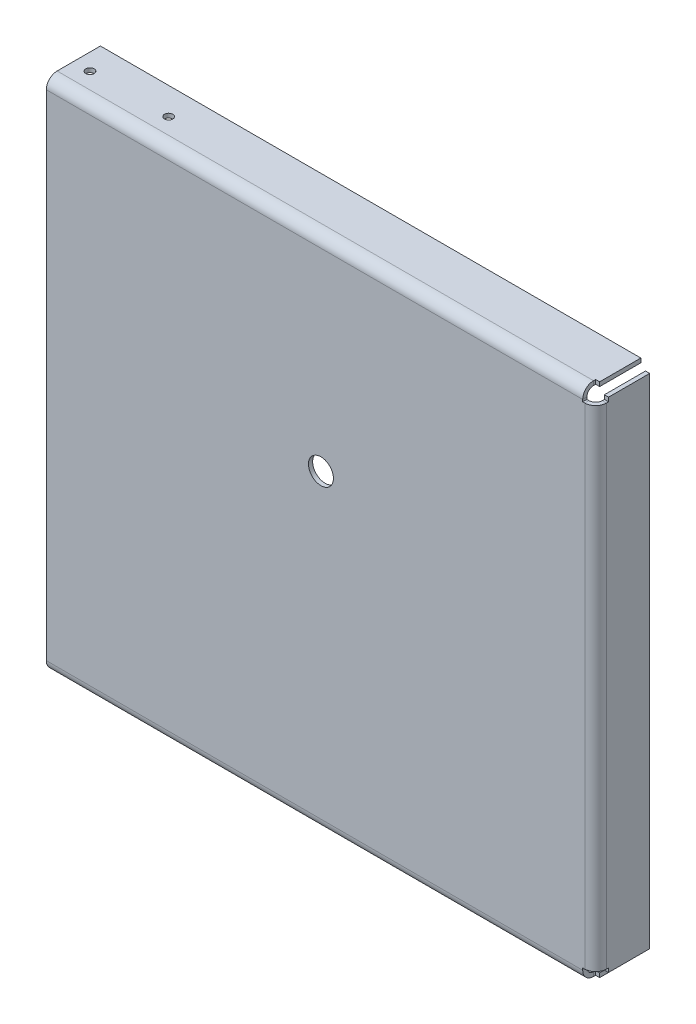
ISO-10303-21;
HEADER;
FILE_DESCRIPTION(('STEP AP214'),'2;1');
FILE_NAME('part.step','',(''),(''),'','','');
FILE_SCHEMA(('AUTOMOTIVE_DESIGN { 1 0 10303 214 1 1 1 1 }'));
ENDSEC;
DATA;
#1=APPLICATION_CONTEXT('core data for automotive mechanical design processes');
#2=APPLICATION_PROTOCOL_DEFINITION('international standard','automotive_design',2000,#1);
#3=PRODUCT_CONTEXT('',#1,'mechanical');
#4=PRODUCT('Part','Part','',(#3));
#5=PRODUCT_RELATED_PRODUCT_CATEGORY('part','',(#4));
#6=PRODUCT_DEFINITION_FORMATION('','',#4);
#7=PRODUCT_DEFINITION_CONTEXT('part definition',#1,'design');
#8=PRODUCT_DEFINITION('design','',#6,#7);
#9=PRODUCT_DEFINITION_SHAPE('','',#8);
#10=(LENGTH_UNIT() NAMED_UNIT(*) SI_UNIT(.MILLI.,.METRE.));
#11=(NAMED_UNIT(*) PLANE_ANGLE_UNIT() SI_UNIT($,.RADIAN.));
#12=(NAMED_UNIT(*) SI_UNIT($,.STERADIAN.) SOLID_ANGLE_UNIT());
#13=UNCERTAINTY_MEASURE_WITH_UNIT(LENGTH_MEASURE(1.E-05),#10,'distance_accuracy_value','');
#14=(GEOMETRIC_REPRESENTATION_CONTEXT(3) GLOBAL_UNCERTAINTY_ASSIGNED_CONTEXT((#13)) GLOBAL_UNIT_ASSIGNED_CONTEXT((#10,
#11,#12)) REPRESENTATION_CONTEXT('',''));
#15=CARTESIAN_POINT('',(0.,0.,0.));
#16=DIRECTION('',(0.,0.,1.));
#17=DIRECTION('',(1.,0.,0.));
#18=AXIS2_PLACEMENT_3D('',#15,#16,#17);
#19=CARTESIAN_POINT('',(517.316448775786,1666.19042069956,1.58749999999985));
#20=DIRECTION('',(-1.,0.,0.));
#21=DIRECTION('',(0.,-1.,0.));
#22=AXIS2_PLACEMENT_3D('',#19,#20,#21);
#23=PLANE('',#22);
#24=DIRECTION('',(0.,-1.,0.));
#25=VECTOR('',#24,1.);
#26=CARTESIAN_POINT('',(517.316448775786,1666.19042069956,-3.33375000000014));
#27=LINE('',#26,#25);
#28=CARTESIAN_POINT('',(517.316448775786,1252.5375,-3.33375000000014));
#29=VERTEX_POINT('',#28);
#30=CARTESIAN_POINT('',(517.316448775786,1250.95,-3.33375000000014));
#31=VERTEX_POINT('',#30);
#32=EDGE_CURVE('E463',#29,#31,#27,.T.);
#33=ORIENTED_EDGE('',*,*,#32,.T.);
#34=DIRECTION('',(0.,0.,1.));
#35=VECTOR('',#34,1.);
#36=CARTESIAN_POINT('',(517.316448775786,1250.95,-31.7500000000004));
#37=LINE('',#36,#35);
#38=CARTESIAN_POINT('',(517.316448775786,1250.95,-19.0500000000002));
#39=VERTEX_POINT('',#38);
#40=EDGE_CURVE('E86',#39,#31,#37,.T.);
#41=ORIENTED_EDGE('',*,*,#40,.F.);
#42=DIRECTION('',(0.,-1.,0.));
#43=VECTOR('',#42,1.);
#44=CARTESIAN_POINT('',(517.316448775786,1666.19042069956,-19.0500000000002));
#45=LINE('',#44,#43);
#46=CARTESIAN_POINT('',(517.316448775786,1252.5375,-19.0500000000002));
#47=VERTEX_POINT('',#46);
#48=EDGE_CURVE('E460',#47,#39,#45,.T.);
#49=ORIENTED_EDGE('',*,*,#48,.F.);
#50=DIRECTION('',(0.,0.,-1.));
#51=VECTOR('',#50,1.);
#52=CARTESIAN_POINT('',(517.316448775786,1252.5375,1.58749999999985));
#53=LINE('',#52,#51);
#54=EDGE_CURVE('E11',#29,#47,#53,.T.);
#55=ORIENTED_EDGE('',*,*,#54,.F.);
#56=EDGE_LOOP('',(#33,#41,#49,#55));
#57=FACE_BOUND('',#56,.T.);
#58=ADVANCED_FACE('F34',(#57),#23,.F.);
#59=CARTESIAN_POINT('',(311.15,1666.19042069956,-19.0500000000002));
#60=DIRECTION('',(0.,0.,-1.));
#61=DIRECTION('',(0.,1.,0.));
#62=AXIS2_PLACEMENT_3D('',#59,#60,#61);
#63=PLANE('',#62);
#64=DIRECTION('',(1.,0.,0.));
#65=VECTOR('',#64,1.);
#66=CARTESIAN_POINT('',(311.15,1250.95,-19.0500000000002));
#67=LINE('',#66,#65);
#68=CARTESIAN_POINT('',(311.15,1250.95,-19.0500000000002));
#69=VERTEX_POINT('',#68);
#70=EDGE_CURVE('E438',#69,#39,#67,.T.);
#71=ORIENTED_EDGE('',*,*,#70,.F.);
#72=DIRECTION('',(0.,-1.,0.));
#73=VECTOR('',#72,1.);
#74=CARTESIAN_POINT('',(311.15,1666.19042069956,-19.0500000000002));
#75=LINE('',#74,#73);
#76=CARTESIAN_POINT('',(311.15,1252.5375,-19.0500000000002));
#77=VERTEX_POINT('',#76);
#78=EDGE_CURVE('E432',#77,#69,#75,.T.);
#79=ORIENTED_EDGE('',*,*,#78,.F.);
#80=DIRECTION('',(1.,0.,0.));
#81=VECTOR('',#80,1.);
#82=CARTESIAN_POINT('',(311.15,1252.5375,-19.0500000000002));
#83=LINE('',#82,#81);
#84=EDGE_CURVE('E52',#77,#47,#83,.T.);
#85=ORIENTED_EDGE('',*,*,#84,.T.);
#86=ORIENTED_EDGE('',*,*,#48,.T.);
#87=EDGE_LOOP('',(#71,#79,#85,#86));
#88=FACE_BOUND('',#87,.T.);
#89=ADVANCED_FACE('F493',(#88),#63,.T.);
#90=CARTESIAN_POINT('',(317.5,1250.95,-8.73125000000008));
#91=DIRECTION('',(0.,1.,0.));
#92=DIRECTION('',(0.,0.,1.));
#93=AXIS2_PLACEMENT_3D('',#90,#91,#92);
#94=CYLINDRICAL_SURFACE('',#93,1.58750000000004);
#95=CARTESIAN_POINT('',(317.5,1252.5375,-8.73125000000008));
#96=DIRECTION('',(0.,1.,0.));
#97=DIRECTION('',(0.,0.,1.));
#98=AXIS2_PLACEMENT_3D('',#95,#96,#97);
#99=CIRCLE('',#98,1.58750000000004);
#100=CARTESIAN_POINT('',(317.5,1252.5375,-7.14375000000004));
#101=VERTEX_POINT('',#100);
#102=EDGE_CURVE('E457',#101,#101,#99,.T.);
#103=ORIENTED_EDGE('',*,*,#102,.T.);
#104=EDGE_LOOP('',(#103));
#105=FACE_BOUND('',#104,.T.);
#106=CARTESIAN_POINT('',(317.5,1250.95,-8.73125000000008));
#107=DIRECTION('',(0.,1.,0.));
#108=DIRECTION('',(0.,0.,1.));
#109=AXIS2_PLACEMENT_3D('',#106,#107,#108);
#110=CIRCLE('',#109,1.58750000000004);
#111=CARTESIAN_POINT('',(317.5,1250.95,-7.14375000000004));
#112=VERTEX_POINT('',#111);
#113=EDGE_CURVE('E445',#112,#112,#110,.T.);
#114=ORIENTED_EDGE('',*,*,#113,.F.);
#115=EDGE_LOOP('',(#114));
#116=FACE_BOUND('',#115,.T.);
#117=ADVANCED_FACE('F495',(#105,#116),#94,.F.);
#118=CARTESIAN_POINT('',(311.15,1666.19042069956,-3.33375000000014));
#119=DIRECTION('',(0.,0.,1.));
#120=DIRECTION('',(0.,-1.,0.));
#121=AXIS2_PLACEMENT_3D('',#118,#119,#120);
#122=PLANE('',#121);
#123=DIRECTION('',(-1.,0.,0.));
#124=VECTOR('',#123,1.);
#125=CARTESIAN_POINT('',(311.15,1250.95,-3.33375000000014));
#126=LINE('',#125,#124);
#127=CARTESIAN_POINT('',(515.77875,1250.95,-3.33375000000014));
#128=VERTEX_POINT('',#127);
#129=EDGE_CURVE('E79',#31,#128,#126,.T.);
#130=ORIENTED_EDGE('',*,*,#129,.F.);
#131=ORIENTED_EDGE('',*,*,#32,.F.);
#132=DIRECTION('',(-1.,0.,0.));
#133=VECTOR('',#132,1.);
#134=CARTESIAN_POINT('',(311.15,1252.5375,-3.33375000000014));
#135=LINE('',#134,#133);
#136=CARTESIAN_POINT('',(515.77875,1252.5375,-3.33375000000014));
#137=VERTEX_POINT('',#136);
#138=EDGE_CURVE('E454',#29,#137,#135,.T.);
#139=ORIENTED_EDGE('',*,*,#138,.T.);
#140=DIRECTION('',(0.,-1.,0.));
#141=VECTOR('',#140,1.);
#142=CARTESIAN_POINT('',(515.77875,1666.19042069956,-3.33375000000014));
#143=LINE('',#142,#141);
#144=EDGE_CURVE('E452',#137,#128,#143,.T.);
#145=ORIENTED_EDGE('',*,*,#144,.T.);
#146=EDGE_LOOP('',(#130,#131,#139,#145));
#147=FACE_BOUND('',#146,.T.);
#148=ADVANCED_FACE('F490',(#147),#122,.T.);
#149=CARTESIAN_POINT('',(515.77875,1666.19042069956,1.58749999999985));
#150=DIRECTION('',(-1.,0.,0.));
#151=DIRECTION('',(0.,-1.,0.));
#152=AXIS2_PLACEMENT_3D('',#149,#150,#151);
#153=PLANE('',#152);
#154=DIRECTION('',(0.,-1.,0.));
#155=VECTOR('',#154,1.);
#156=CARTESIAN_POINT('',(515.77875,1666.19042069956,-2.53999999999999));
#157=LINE('',#156,#155);
#158=CARTESIAN_POINT('',(515.77875,1252.5375,-2.54000000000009));
#159=VERTEX_POINT('',#158);
#160=CARTESIAN_POINT('',(515.77875,1250.95,-2.54000000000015));
#161=VERTEX_POINT('',#160);
#162=EDGE_CURVE('E450',#159,#161,#157,.T.);
#163=ORIENTED_EDGE('',*,*,#162,.T.);
#164=DIRECTION('',(0.,0.,-1.));
#165=VECTOR('',#164,1.);
#166=CARTESIAN_POINT('',(515.77875,1250.95,1.58749999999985));
#167=LINE('',#166,#165);
#168=EDGE_CURVE('E448',#161,#128,#167,.T.);
#169=ORIENTED_EDGE('',*,*,#168,.T.);
#170=ORIENTED_EDGE('',*,*,#144,.F.);
#171=DIRECTION('',(0.,0.,-1.));
#172=VECTOR('',#171,1.);
#173=CARTESIAN_POINT('',(515.77875,1252.5375,1.58749999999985));
#174=LINE('',#173,#172);
#175=EDGE_CURVE('E44',#159,#137,#174,.T.);
#176=ORIENTED_EDGE('',*,*,#175,.F.);
#177=EDGE_LOOP('',(#163,#169,#170,#176));
#178=FACE_BOUND('',#177,.T.);
#179=ADVANCED_FACE('F489',(#178),#153,.F.);
#180=CARTESIAN_POINT('',(311.15,1250.95,1.58749999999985));
#181=DIRECTION('',(0.,1.,0.));
#182=DIRECTION('',(0.,0.,1.));
#183=AXIS2_PLACEMENT_3D('',#180,#181,#182);
#184=PLANE('',#183);
#185=CARTESIAN_POINT('',(347.5,1250.95,-8.73125));
#186=DIRECTION('',(0.,1.,0.));
#187=DIRECTION('',(0.,0.,1.));
#188=AXIS2_PLACEMENT_3D('',#185,#186,#187);
#189=CIRCLE('',#188,1.58750000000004);
#190=CARTESIAN_POINT('',(347.5,1250.95,-7.14374999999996));
#191=VERTEX_POINT('',#190);
#192=EDGE_CURVE('E530',#191,#191,#189,.T.);
#193=ORIENTED_EDGE('',*,*,#192,.T.);
#194=EDGE_LOOP('',(#193));
#195=FACE_BOUND('',#194,.T.);
#196=ORIENTED_EDGE('',*,*,#113,.T.);
#197=EDGE_LOOP('',(#196));
#198=FACE_BOUND('',#197,.T.);
#199=ORIENTED_EDGE('',*,*,#168,.F.);
#200=DIRECTION('',(-1.,0.,0.));
#201=VECTOR('',#200,1.);
#202=CARTESIAN_POINT('',(515.77875,1250.95,-2.53999999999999));
#203=LINE('',#202,#201);
#204=CARTESIAN_POINT('',(311.15,1250.95,-2.53999999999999));
#205=VERTEX_POINT('',#204);
#206=EDGE_CURVE('E292',#161,#205,#203,.T.);
#207=ORIENTED_EDGE('',*,*,#206,.T.);
#208=DIRECTION('',(0.,0.,-1.));
#209=VECTOR('',#208,1.);
#210=CARTESIAN_POINT('',(311.15,1250.95,1.58749999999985));
#211=LINE('',#210,#209);
#212=EDGE_CURVE('E441',#205,#69,#211,.T.);
#213=ORIENTED_EDGE('',*,*,#212,.T.);
#214=ORIENTED_EDGE('',*,*,#70,.T.);
#215=ORIENTED_EDGE('',*,*,#40,.T.);
#216=ORIENTED_EDGE('',*,*,#129,.T.);
#217=EDGE_LOOP('',(#199,#207,#213,#214,#215,#216));
#218=FACE_BOUND('',#217,.T.);
#219=ADVANCED_FACE('F486',(#195,#198,#218),#184,.F.);
#220=CARTESIAN_POINT('',(311.15,1666.19042069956,1.58749999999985));
#221=DIRECTION('',(-1.,0.,0.));
#222=DIRECTION('',(0.,-1.,0.));
#223=AXIS2_PLACEMENT_3D('',#220,#221,#222);
#224=PLANE('',#223);
#225=ORIENTED_EDGE('',*,*,#212,.F.);
#226=DIRECTION('',(0.,-1.,0.));
#227=VECTOR('',#226,1.);
#228=CARTESIAN_POINT('',(311.15,1666.19042069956,-2.53999999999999));
#229=LINE('',#228,#227);
#230=CARTESIAN_POINT('',(311.15,1252.5375,-2.54000000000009));
#231=VERTEX_POINT('',#230);
#232=EDGE_CURVE('E465',#231,#205,#229,.T.);
#233=ORIENTED_EDGE('',*,*,#232,.F.);
#234=DIRECTION('',(0.,0.,-1.));
#235=VECTOR('',#234,1.);
#236=CARTESIAN_POINT('',(311.15,1252.5375,1.58749999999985));
#237=LINE('',#236,#235);
#238=EDGE_CURVE('E434',#231,#77,#237,.T.);
#239=ORIENTED_EDGE('',*,*,#238,.T.);
#240=ORIENTED_EDGE('',*,*,#78,.T.);
#241=EDGE_LOOP('',(#225,#233,#239,#240));
#242=FACE_BOUND('',#241,.T.);
#243=ADVANCED_FACE('F482',(#242),#224,.T.);
#244=CARTESIAN_POINT('',(311.15,1252.5375,1.58749999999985));
#245=DIRECTION('',(0.,1.,0.));
#246=DIRECTION('',(0.,0.,1.));
#247=AXIS2_PLACEMENT_3D('',#244,#245,#246);
#248=PLANE('',#247);
#249=CARTESIAN_POINT('',(347.5,1252.5375,-8.73125));
#250=DIRECTION('',(0.,1.,0.));
#251=DIRECTION('',(0.,0.,1.));
#252=AXIS2_PLACEMENT_3D('',#249,#250,#251);
#253=CIRCLE('',#252,1.58750000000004);
#254=CARTESIAN_POINT('',(347.5,1252.5375,-7.14374999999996));
#255=VERTEX_POINT('',#254);
#256=EDGE_CURVE('E525',#255,#255,#253,.T.);
#257=ORIENTED_EDGE('',*,*,#256,.F.);
#258=EDGE_LOOP('',(#257));
#259=FACE_BOUND('',#258,.T.);
#260=DIRECTION('',(-1.,0.,0.));
#261=VECTOR('',#260,1.);
#262=CARTESIAN_POINT('',(515.77875,1252.5375,-2.53999999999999));
#263=LINE('',#262,#261);
#264=EDGE_CURVE('E376',#159,#231,#263,.T.);
#265=ORIENTED_EDGE('',*,*,#264,.F.);
#266=ORIENTED_EDGE('',*,*,#175,.T.);
#267=ORIENTED_EDGE('',*,*,#138,.F.);
#268=ORIENTED_EDGE('',*,*,#54,.T.);
#269=ORIENTED_EDGE('',*,*,#84,.F.);
#270=ORIENTED_EDGE('',*,*,#238,.F.);
#271=EDGE_LOOP('',(#265,#266,#267,#268,#269,#270));
#272=FACE_BOUND('',#271,.T.);
#273=ORIENTED_EDGE('',*,*,#102,.F.);
#274=EDGE_LOOP('',(#273));
#275=FACE_BOUND('',#274,.T.);
#276=ADVANCED_FACE('F36',(#259,#272,#275),#248,.T.);
#277=CARTESIAN_POINT('',(137.515392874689,1444.41644877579,1.58749999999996));
#278=DIRECTION('',(0.,-1.,0.));
#279=DIRECTION('',(-1.,0.,0.));
#280=AXIS2_PLACEMENT_3D('',#277,#278,#279);
#281=PLANE('',#280);
#282=DIRECTION('',(1.,0.,0.));
#283=VECTOR('',#282,1.);
#284=CARTESIAN_POINT('',(137.515392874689,1444.41644877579,-3.33375000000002));
#285=LINE('',#284,#283);
#286=CARTESIAN_POINT('',(519.1125,1444.41644877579,-3.33375000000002));
#287=VERTEX_POINT('',#286);
#288=CARTESIAN_POINT('',(520.7,1444.41644877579,-3.33375000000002));
#289=VERTEX_POINT('',#288);
#290=EDGE_CURVE('E425',#287,#289,#285,.T.);
#291=ORIENTED_EDGE('',*,*,#290,.T.);
#292=DIRECTION('',(0.,0.,1.));
#293=VECTOR('',#292,1.);
#294=CARTESIAN_POINT('',(520.7,1444.41644877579,-31.7499999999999));
#295=LINE('',#294,#293);
#296=CARTESIAN_POINT('',(520.7,1444.41644877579,-19.05));
#297=VERTEX_POINT('',#296);
#298=EDGE_CURVE('E391',#297,#289,#295,.T.);
#299=ORIENTED_EDGE('',*,*,#298,.F.);
#300=DIRECTION('',(1.,0.,0.));
#301=VECTOR('',#300,1.);
#302=CARTESIAN_POINT('',(137.515392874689,1444.41644877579,-19.05));
#303=LINE('',#302,#301);
#304=CARTESIAN_POINT('',(519.1125,1444.41644877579,-19.05));
#305=VERTEX_POINT('',#304);
#306=EDGE_CURVE('E422',#305,#297,#303,.T.);
#307=ORIENTED_EDGE('',*,*,#306,.F.);
#308=DIRECTION('',(0.,0.,-1.));
#309=VECTOR('',#308,1.);
#310=CARTESIAN_POINT('',(519.1125,1444.41644877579,1.58749999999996));
#311=LINE('',#310,#309);
#312=EDGE_CURVE('E142',#287,#305,#311,.T.);
#313=ORIENTED_EDGE('',*,*,#312,.F.);
#314=EDGE_LOOP('',(#291,#299,#307,#313));
#315=FACE_BOUND('',#314,.T.);
#316=ADVANCED_FACE('F516',(#315),#281,.F.);
#317=CARTESIAN_POINT('',(137.515392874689,1250.95,-19.05));
#318=DIRECTION('',(0.,0.,-1.));
#319=DIRECTION('',(-1.,0.,0.));
#320=AXIS2_PLACEMENT_3D('',#317,#318,#319);
#321=PLANE('',#320);
#322=DIRECTION('',(0.,1.,0.));
#323=VECTOR('',#322,1.);
#324=CARTESIAN_POINT('',(520.7,1250.95,-19.05));
#325=LINE('',#324,#323);
#326=CARTESIAN_POINT('',(520.7,1254.33355122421,-19.05));
#327=VERTEX_POINT('',#326);
#328=EDGE_CURVE('E393',#327,#297,#325,.T.);
#329=ORIENTED_EDGE('',*,*,#328,.F.);
#330=DIRECTION('',(1.,0.,0.));
#331=VECTOR('',#330,1.);
#332=CARTESIAN_POINT('',(137.515392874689,1254.33355122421,-19.05));
#333=LINE('',#332,#331);
#334=CARTESIAN_POINT('',(519.1125,1254.33355122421,-19.05));
#335=VERTEX_POINT('',#334);
#336=EDGE_CURVE('E419',#335,#327,#333,.T.);
#337=ORIENTED_EDGE('',*,*,#336,.F.);
#338=DIRECTION('',(0.,1.,0.));
#339=VECTOR('',#338,1.);
#340=CARTESIAN_POINT('',(519.1125,1250.95,-19.05));
#341=LINE('',#340,#339);
#342=EDGE_CURVE('E135',#335,#305,#341,.T.);
#343=ORIENTED_EDGE('',*,*,#342,.T.);
#344=ORIENTED_EDGE('',*,*,#306,.T.);
#345=EDGE_LOOP('',(#329,#337,#343,#344));
#346=FACE_BOUND('',#345,.T.);
#347=ADVANCED_FACE('F521',(#346),#321,.T.);
#348=CARTESIAN_POINT('',(137.515392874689,1254.33355122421,1.58749999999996));
#349=DIRECTION('',(0.,1.,0.));
#350=DIRECTION('',(1.,0.,0.));
#351=AXIS2_PLACEMENT_3D('',#348,#349,#350);
#352=PLANE('',#351);
#353=ORIENTED_EDGE('',*,*,#336,.T.);
#354=DIRECTION('',(0.,0.,1.));
#355=VECTOR('',#354,1.);
#356=CARTESIAN_POINT('',(520.7,1254.33355122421,-31.7500000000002));
#357=LINE('',#356,#355);
#358=CARTESIAN_POINT('',(520.7,1254.33355122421,-3.33375000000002));
#359=VERTEX_POINT('',#358);
#360=EDGE_CURVE('E416',#327,#359,#357,.T.);
#361=ORIENTED_EDGE('',*,*,#360,.T.);
#362=DIRECTION('',(1.,0.,0.));
#363=VECTOR('',#362,1.);
#364=CARTESIAN_POINT('',(137.515392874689,1254.33355122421,-3.33375000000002));
#365=LINE('',#364,#363);
#366=CARTESIAN_POINT('',(519.1125,1254.33355122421,-3.33375000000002));
#367=VERTEX_POINT('',#366);
#368=EDGE_CURVE('E411',#367,#359,#365,.T.);
#369=ORIENTED_EDGE('',*,*,#368,.F.);
#370=DIRECTION('',(0.,0.,1.));
#371=VECTOR('',#370,1.);
#372=CARTESIAN_POINT('',(519.1125,1254.33355122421,1.58749999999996));
#373=LINE('',#372,#371);
#374=EDGE_CURVE('E377',#335,#367,#373,.T.);
#375=ORIENTED_EDGE('',*,*,#374,.F.);
#376=EDGE_LOOP('',(#353,#361,#369,#375));
#377=FACE_BOUND('',#376,.T.);
#378=ADVANCED_FACE('F683',(#377),#352,.F.);
#379=CARTESIAN_POINT('',(137.515392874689,1250.95,-3.33375000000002));
#380=DIRECTION('',(0.,0.,1.));
#381=DIRECTION('',(1.,0.,0.));
#382=AXIS2_PLACEMENT_3D('',#379,#380,#381);
#383=PLANE('',#382);
#384=DIRECTION('',(0.,-1.,0.));
#385=VECTOR('',#384,1.);
#386=CARTESIAN_POINT('',(520.7,1250.95,-3.33375000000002));
#387=LINE('',#386,#385);
#388=CARTESIAN_POINT('',(520.7,1255.87125,-3.33375000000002));
#389=VERTEX_POINT('',#388);
#390=EDGE_CURVE('E395',#389,#359,#387,.T.);
#391=ORIENTED_EDGE('',*,*,#390,.F.);
#392=DIRECTION('',(1.,0.,0.));
#393=VECTOR('',#392,1.);
#394=CARTESIAN_POINT('',(137.515392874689,1255.87125,-3.33375000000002));
#395=LINE('',#394,#393);
#396=CARTESIAN_POINT('',(519.1125,1255.87125,-3.33375000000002));
#397=VERTEX_POINT('',#396);
#398=EDGE_CURVE('E387',#397,#389,#395,.T.);
#399=ORIENTED_EDGE('',*,*,#398,.F.);
#400=DIRECTION('',(0.,-1.,0.));
#401=VECTOR('',#400,1.);
#402=CARTESIAN_POINT('',(519.1125,1250.95,-3.33375000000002));
#403=LINE('',#402,#401);
#404=EDGE_CURVE('E414',#397,#367,#403,.T.);
#405=ORIENTED_EDGE('',*,*,#404,.T.);
#406=ORIENTED_EDGE('',*,*,#368,.T.);
#407=EDGE_LOOP('',(#391,#399,#405,#406));
#408=FACE_BOUND('',#407,.T.);
#409=ADVANCED_FACE('F686',(#408),#383,.T.);
#410=CARTESIAN_POINT('',(137.515392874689,1250.95,-3.33375000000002));
#411=DIRECTION('',(0.,0.,1.));
#412=DIRECTION('',(1.,0.,0.));
#413=AXIS2_PLACEMENT_3D('',#410,#411,#412);
#414=PLANE('',#413);
#415=DIRECTION('',(0.,-1.,0.));
#416=VECTOR('',#415,1.);
#417=CARTESIAN_POINT('',(520.7,1250.95,-3.33375000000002));
#418=LINE('',#417,#416);
#419=CARTESIAN_POINT('',(520.7,1442.87875,-3.33375000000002));
#420=VERTEX_POINT('',#419);
#421=EDGE_CURVE('E389',#289,#420,#418,.T.);
#422=ORIENTED_EDGE('',*,*,#421,.F.);
#423=ORIENTED_EDGE('',*,*,#290,.F.);
#424=DIRECTION('',(0.,-1.,0.));
#425=VECTOR('',#424,1.);
#426=CARTESIAN_POINT('',(519.1125,1250.95,-3.33375000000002));
#427=LINE('',#426,#425);
#428=CARTESIAN_POINT('',(519.1125,1442.87875,-3.33375000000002));
#429=VERTEX_POINT('',#428);
#430=EDGE_CURVE('E409',#287,#429,#427,.T.);
#431=ORIENTED_EDGE('',*,*,#430,.T.);
#432=DIRECTION('',(1.,0.,0.));
#433=VECTOR('',#432,1.);
#434=CARTESIAN_POINT('',(137.515392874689,1442.87875,-3.33375000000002));
#435=LINE('',#434,#433);
#436=EDGE_CURVE('E406',#429,#420,#435,.T.);
#437=ORIENTED_EDGE('',*,*,#436,.T.);
#438=EDGE_LOOP('',(#422,#423,#431,#437));
#439=FACE_BOUND('',#438,.T.);
#440=ADVANCED_FACE('F690',(#439),#414,.T.);
#441=CARTESIAN_POINT('',(137.515392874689,1442.87875,1.58749999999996));
#442=DIRECTION('',(0.,-1.,0.));
#443=DIRECTION('',(-1.,0.,0.));
#444=AXIS2_PLACEMENT_3D('',#441,#442,#443);
#445=PLANE('',#444);
#446=DIRECTION('',(1.,0.,0.));
#447=VECTOR('',#446,1.);
#448=CARTESIAN_POINT('',(137.515392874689,1442.87875,-2.53999999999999));
#449=LINE('',#448,#447);
#450=CARTESIAN_POINT('',(519.1125,1442.87875,-2.53999999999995));
#451=VERTEX_POINT('',#450);
#452=CARTESIAN_POINT('',(520.7,1442.87875,-2.53999999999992));
#453=VERTEX_POINT('',#452);
#454=EDGE_CURVE('E403',#451,#453,#449,.T.);
#455=ORIENTED_EDGE('',*,*,#454,.T.);
#456=DIRECTION('',(0.,0.,-1.));
#457=VECTOR('',#456,1.);
#458=CARTESIAN_POINT('',(520.7,1442.87875,1.58749999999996));
#459=LINE('',#458,#457);
#460=EDGE_CURVE('E400',#453,#420,#459,.T.);
#461=ORIENTED_EDGE('',*,*,#460,.T.);
#462=ORIENTED_EDGE('',*,*,#436,.F.);
#463=DIRECTION('',(0.,0.,-1.));
#464=VECTOR('',#463,1.);
#465=CARTESIAN_POINT('',(519.1125,1442.87875,1.58749999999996));
#466=LINE('',#465,#464);
#467=EDGE_CURVE('E381',#451,#429,#466,.T.);
#468=ORIENTED_EDGE('',*,*,#467,.F.);
#469=EDGE_LOOP('',(#455,#461,#462,#468));
#470=FACE_BOUND('',#469,.T.);
#471=ADVANCED_FACE('F694',(#470),#445,.F.);
#472=CARTESIAN_POINT('',(520.7,1250.95,1.58749999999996));
#473=DIRECTION('',(-1.,0.,0.));
#474=DIRECTION('',(0.,0.,1.));
#475=AXIS2_PLACEMENT_3D('',#472,#473,#474);
#476=PLANE('',#475);
#477=ORIENTED_EDGE('',*,*,#460,.F.);
#478=DIRECTION('',(0.,-1.,0.));
#479=VECTOR('',#478,1.);
#480=CARTESIAN_POINT('',(520.7,1442.87875,-2.53999999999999));
#481=LINE('',#480,#479);
#482=CARTESIAN_POINT('',(520.7,1255.87125,-2.53999999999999));
#483=VERTEX_POINT('',#482);
#484=EDGE_CURVE('E397',#453,#483,#481,.T.);
#485=ORIENTED_EDGE('',*,*,#484,.T.);
#486=DIRECTION('',(0.,0.,1.));
#487=VECTOR('',#486,1.);
#488=CARTESIAN_POINT('',(520.7,1255.87125,1.58749999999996));
#489=LINE('',#488,#487);
#490=EDGE_CURVE('E384',#389,#483,#489,.T.);
#491=ORIENTED_EDGE('',*,*,#490,.F.);
#492=ORIENTED_EDGE('',*,*,#390,.T.);
#493=ORIENTED_EDGE('',*,*,#360,.F.);
#494=ORIENTED_EDGE('',*,*,#328,.T.);
#495=ORIENTED_EDGE('',*,*,#298,.T.);
#496=ORIENTED_EDGE('',*,*,#421,.T.);
#497=EDGE_LOOP('',(#477,#485,#491,#492,#493,#494,#495,#496));
#498=FACE_BOUND('',#497,.T.);
#499=ADVANCED_FACE('F600',(#498),#476,.F.);
#500=CARTESIAN_POINT('',(137.515392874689,1255.87125,1.58749999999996));
#501=DIRECTION('',(0.,1.,0.));
#502=DIRECTION('',(1.,0.,0.));
#503=AXIS2_PLACEMENT_3D('',#500,#501,#502);
#504=PLANE('',#503);
#505=ORIENTED_EDGE('',*,*,#398,.T.);
#506=ORIENTED_EDGE('',*,*,#490,.T.);
#507=DIRECTION('',(1.,0.,0.));
#508=VECTOR('',#507,1.);
#509=CARTESIAN_POINT('',(137.515392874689,1255.87125,-2.53999999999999));
#510=LINE('',#509,#508);
#511=CARTESIAN_POINT('',(519.1125,1255.87125,-2.53999999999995));
#512=VERTEX_POINT('',#511);
#513=EDGE_CURVE('E427',#512,#483,#510,.T.);
#514=ORIENTED_EDGE('',*,*,#513,.F.);
#515=DIRECTION('',(0.,0.,1.));
#516=VECTOR('',#515,1.);
#517=CARTESIAN_POINT('',(519.1125,1255.87125,1.58749999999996));
#518=LINE('',#517,#516);
#519=EDGE_CURVE('E95',#397,#512,#518,.T.);
#520=ORIENTED_EDGE('',*,*,#519,.F.);
#521=EDGE_LOOP('',(#505,#506,#514,#520));
#522=FACE_BOUND('',#521,.T.);
#523=ADVANCED_FACE('F596',(#522),#504,.F.);
#524=CARTESIAN_POINT('',(519.1125,1250.95,1.58749999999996));
#525=DIRECTION('',(-1.,0.,0.));
#526=DIRECTION('',(0.,0.,1.));
#527=AXIS2_PLACEMENT_3D('',#524,#525,#526);
#528=PLANE('',#527);
#529=DIRECTION('',(0.,-1.,0.));
#530=VECTOR('',#529,1.);
#531=CARTESIAN_POINT('',(519.1125,1442.87875,-2.53999999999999));
#532=LINE('',#531,#530);
#533=EDGE_CURVE('E329',#451,#512,#532,.T.);
#534=ORIENTED_EDGE('',*,*,#533,.F.);
#535=ORIENTED_EDGE('',*,*,#467,.T.);
#536=ORIENTED_EDGE('',*,*,#430,.F.);
#537=ORIENTED_EDGE('',*,*,#312,.T.);
#538=ORIENTED_EDGE('',*,*,#342,.F.);
#539=ORIENTED_EDGE('',*,*,#374,.T.);
#540=ORIENTED_EDGE('',*,*,#404,.F.);
#541=ORIENTED_EDGE('',*,*,#519,.T.);
#542=EDGE_LOOP('',(#534,#535,#536,#537,#538,#539,#540,#541));
#543=FACE_BOUND('',#542,.T.);
#544=ADVANCED_FACE('F657',(#543),#528,.T.);
#545=CARTESIAN_POINT('',(517.316448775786,1032.55957930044,1.58749999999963));
#546=DIRECTION('',(-1.,0.,0.));
#547=DIRECTION('',(0.,1.,0.));
#548=AXIS2_PLACEMENT_3D('',#545,#546,#547);
#549=PLANE('',#548);
#550=DIRECTION('',(0.,1.,0.));
#551=VECTOR('',#550,1.);
#552=CARTESIAN_POINT('',(517.316448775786,1032.55957930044,-19.0500000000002));
#553=LINE('',#552,#551);
#554=CARTESIAN_POINT('',(517.316448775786,1446.2125,-19.0500000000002));
#555=VERTEX_POINT('',#554);
#556=CARTESIAN_POINT('',(517.316448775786,1447.8,-19.0500000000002));
#557=VERTEX_POINT('',#556);
#558=EDGE_CURVE('E369',#555,#557,#553,.T.);
#559=ORIENTED_EDGE('',*,*,#558,.T.);
#560=DIRECTION('',(0.,0.,1.));
#561=VECTOR('',#560,1.);
#562=CARTESIAN_POINT('',(517.316448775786,1447.8,-31.7500000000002));
#563=LINE('',#562,#561);
#564=CARTESIAN_POINT('',(517.316448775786,1447.8,-3.33375000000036));
#565=VERTEX_POINT('',#564);
#566=EDGE_CURVE('E366',#557,#565,#563,.T.);
#567=ORIENTED_EDGE('',*,*,#566,.T.);
#568=DIRECTION('',(0.,1.,0.));
#569=VECTOR('',#568,1.);
#570=CARTESIAN_POINT('',(517.316448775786,1032.55957930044,-3.33375000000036));
#571=LINE('',#570,#569);
#572=CARTESIAN_POINT('',(517.316448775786,1446.2125,-3.33375000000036));
#573=VERTEX_POINT('',#572);
#574=EDGE_CURVE('E363',#573,#565,#571,.T.);
#575=ORIENTED_EDGE('',*,*,#574,.F.);
#576=DIRECTION('',(0.,0.,1.));
#577=VECTOR('',#576,1.);
#578=CARTESIAN_POINT('',(517.316448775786,1446.2125,1.58749999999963));
#579=LINE('',#578,#577);
#580=EDGE_CURVE('E184',#555,#573,#579,.T.);
#581=ORIENTED_EDGE('',*,*,#580,.F.);
#582=EDGE_LOOP('',(#559,#567,#575,#581));
#583=FACE_BOUND('',#582,.T.);
#584=ADVANCED_FACE('F653',(#583),#549,.F.);
#585=CARTESIAN_POINT('',(520.7,1032.55957930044,-3.33375000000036));
#586=DIRECTION('',(0.,0.,1.));
#587=DIRECTION('',(0.,-1.,0.));
#588=AXIS2_PLACEMENT_3D('',#585,#586,#587);
#589=PLANE('',#588);
#590=DIRECTION('',(1.,0.,0.));
#591=VECTOR('',#590,1.);
#592=CARTESIAN_POINT('',(520.7,1447.8,-3.33375000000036));
#593=LINE('',#592,#591);
#594=CARTESIAN_POINT('',(515.77875,1447.8,-3.33375000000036));
#595=VERTEX_POINT('',#594);
#596=EDGE_CURVE('E341',#595,#565,#593,.T.);
#597=ORIENTED_EDGE('',*,*,#596,.F.);
#598=DIRECTION('',(0.,1.,0.));
#599=VECTOR('',#598,1.);
#600=CARTESIAN_POINT('',(515.77875,1032.55957930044,-3.33375000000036));
#601=LINE('',#600,#599);
#602=CARTESIAN_POINT('',(515.77875,1446.2125,-3.33375000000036));
#603=VERTEX_POINT('',#602);
#604=EDGE_CURVE('E337',#603,#595,#601,.T.);
#605=ORIENTED_EDGE('',*,*,#604,.F.);
#606=DIRECTION('',(1.,0.,0.));
#607=VECTOR('',#606,1.);
#608=CARTESIAN_POINT('',(520.7,1446.2125,-3.33375000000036));
#609=LINE('',#608,#607);
#610=EDGE_CURVE('E178',#603,#573,#609,.T.);
#611=ORIENTED_EDGE('',*,*,#610,.T.);
#612=ORIENTED_EDGE('',*,*,#574,.T.);
#613=EDGE_LOOP('',(#597,#605,#611,#612));
#614=FACE_BOUND('',#613,.T.);
#615=ADVANCED_FACE('F656',(#614),#589,.T.);
#616=CARTESIAN_POINT('',(317.5,1250.95,-8.7312500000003));
#617=DIRECTION('',(0.,1.,0.));
#618=DIRECTION('',(0.,0.,1.));
#619=AXIS2_PLACEMENT_3D('',#616,#617,#618);
#620=CYLINDRICAL_SURFACE('',#619,1.58750000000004);
#621=CARTESIAN_POINT('',(317.5,1446.2125,-8.7312500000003));
#622=DIRECTION('',(0.,-1.,0.));
#623=DIRECTION('',(0.,0.,-1.));
#624=AXIS2_PLACEMENT_3D('',#621,#622,#623);
#625=CIRCLE('',#624,1.58750000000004);
#626=CARTESIAN_POINT('',(317.5,1446.2125,-10.3187500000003));
#627=VERTEX_POINT('',#626);
#628=EDGE_CURVE('E360',#627,#627,#625,.T.);
#629=ORIENTED_EDGE('',*,*,#628,.T.);
#630=EDGE_LOOP('',(#629));
#631=FACE_BOUND('',#630,.T.);
#632=CARTESIAN_POINT('',(317.5,1447.8,-8.7312500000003));
#633=DIRECTION('',(0.,1.,0.));
#634=DIRECTION('',(0.,0.,1.));
#635=AXIS2_PLACEMENT_3D('',#632,#633,#634);
#636=CIRCLE('',#635,1.58750000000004);
#637=CARTESIAN_POINT('',(317.5,1447.8,-7.14375000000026));
#638=VERTEX_POINT('',#637);
#639=EDGE_CURVE('E357',#638,#638,#636,.T.);
#640=ORIENTED_EDGE('',*,*,#639,.T.);
#641=EDGE_LOOP('',(#640));
#642=FACE_BOUND('',#641,.T.);
#643=ADVANCED_FACE('F660',(#631,#642),#620,.F.);
#644=CARTESIAN_POINT('',(520.7,1032.55957930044,-19.0500000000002));
#645=DIRECTION('',(0.,0.,-1.));
#646=DIRECTION('',(0.,1.,0.));
#647=AXIS2_PLACEMENT_3D('',#644,#645,#646);
#648=PLANE('',#647);
#649=DIRECTION('',(-1.,0.,0.));
#650=VECTOR('',#649,1.);
#651=CARTESIAN_POINT('',(520.7,1447.8,-19.0500000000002));
#652=LINE('',#651,#650);
#653=CARTESIAN_POINT('',(311.15,1447.8,-19.0500000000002));
#654=VERTEX_POINT('',#653);
#655=EDGE_CURVE('E339',#557,#654,#652,.T.);
#656=ORIENTED_EDGE('',*,*,#655,.F.);
#657=ORIENTED_EDGE('',*,*,#558,.F.);
#658=DIRECTION('',(-1.,0.,0.));
#659=VECTOR('',#658,1.);
#660=CARTESIAN_POINT('',(520.7,1446.2125,-19.0500000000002));
#661=LINE('',#660,#659);
#662=CARTESIAN_POINT('',(311.15,1446.2125,-19.0500000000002));
#663=VERTEX_POINT('',#662);
#664=EDGE_CURVE('E355',#555,#663,#661,.T.);
#665=ORIENTED_EDGE('',*,*,#664,.T.);
#666=DIRECTION('',(0.,1.,0.));
#667=VECTOR('',#666,1.);
#668=CARTESIAN_POINT('',(311.15,1032.55957930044,-19.0500000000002));
#669=LINE('',#668,#667);
#670=EDGE_CURVE('E352',#663,#654,#669,.T.);
#671=ORIENTED_EDGE('',*,*,#670,.T.);
#672=EDGE_LOOP('',(#656,#657,#665,#671));
#673=FACE_BOUND('',#672,.T.);
#674=ADVANCED_FACE('F663',(#673),#648,.T.);
#675=CARTESIAN_POINT('',(311.15,1032.55957930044,1.58749999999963));
#676=DIRECTION('',(1.,0.,0.));
#677=DIRECTION('',(0.,-1.,0.));
#678=AXIS2_PLACEMENT_3D('',#675,#676,#677);
#679=PLANE('',#678);
#680=DIRECTION('',(0.,1.,0.));
#681=VECTOR('',#680,1.);
#682=CARTESIAN_POINT('',(311.15,1032.55957930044,-2.53999999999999));
#683=LINE('',#682,#681);
#684=CARTESIAN_POINT('',(311.15,1446.2125,-2.54000000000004));
#685=VERTEX_POINT('',#684);
#686=CARTESIAN_POINT('',(311.15,1447.8,-2.54000000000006));
#687=VERTEX_POINT('',#686);
#688=EDGE_CURVE('E349',#685,#687,#683,.T.);
#689=ORIENTED_EDGE('',*,*,#688,.T.);
#690=DIRECTION('',(0.,0.,-1.));
#691=VECTOR('',#690,1.);
#692=CARTESIAN_POINT('',(311.15,1447.8,1.58749999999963));
#693=LINE('',#692,#691);
#694=EDGE_CURVE('E346',#687,#654,#693,.T.);
#695=ORIENTED_EDGE('',*,*,#694,.T.);
#696=ORIENTED_EDGE('',*,*,#670,.F.);
#697=DIRECTION('',(0.,0.,-1.));
#698=VECTOR('',#697,1.);
#699=CARTESIAN_POINT('',(311.15,1446.2125,1.58749999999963));
#700=LINE('',#699,#698);
#701=EDGE_CURVE('E331',#685,#663,#700,.T.);
#702=ORIENTED_EDGE('',*,*,#701,.F.);
#703=EDGE_LOOP('',(#689,#695,#696,#702));
#704=FACE_BOUND('',#703,.T.);
#705=ADVANCED_FACE('F667',(#704),#679,.F.);
#706=CARTESIAN_POINT('',(520.7,1447.8,1.58749999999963));
#707=DIRECTION('',(0.,-1.,0.));
#708=DIRECTION('',(0.,0.,-1.));
#709=AXIS2_PLACEMENT_3D('',#706,#707,#708);
#710=PLANE('',#709);
#711=CARTESIAN_POINT('',(347.5,1447.8,-8.73125));
#712=DIRECTION('',(0.,1.,0.));
#713=DIRECTION('',(0.,0.,1.));
#714=AXIS2_PLACEMENT_3D('',#711,#712,#713);
#715=CIRCLE('',#714,1.58750000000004);
#716=CARTESIAN_POINT('',(347.5,1447.8,-7.14374999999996));
#717=VERTEX_POINT('',#716);
#718=EDGE_CURVE('E532',#717,#717,#715,.T.);
#719=ORIENTED_EDGE('',*,*,#718,.F.);
#720=EDGE_LOOP('',(#719));
#721=FACE_BOUND('',#720,.T.);
#722=ORIENTED_EDGE('',*,*,#639,.F.);
#723=EDGE_LOOP('',(#722));
#724=FACE_BOUND('',#723,.T.);
#725=ORIENTED_EDGE('',*,*,#694,.F.);
#726=DIRECTION('',(1.,0.,0.));
#727=VECTOR('',#726,1.);
#728=CARTESIAN_POINT('',(311.15,1447.8,-2.53999999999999));
#729=LINE('',#728,#727);
#730=CARTESIAN_POINT('',(515.77875,1447.8,-2.53999999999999));
#731=VERTEX_POINT('',#730);
#732=EDGE_CURVE('E343',#687,#731,#729,.T.);
#733=ORIENTED_EDGE('',*,*,#732,.T.);
#734=DIRECTION('',(0.,0.,1.));
#735=VECTOR('',#734,1.);
#736=CARTESIAN_POINT('',(515.77875,1447.8,1.58749999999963));
#737=LINE('',#736,#735);
#738=EDGE_CURVE('E334',#595,#731,#737,.T.);
#739=ORIENTED_EDGE('',*,*,#738,.F.);
#740=ORIENTED_EDGE('',*,*,#596,.T.);
#741=ORIENTED_EDGE('',*,*,#566,.F.);
#742=ORIENTED_EDGE('',*,*,#655,.T.);
#743=EDGE_LOOP('',(#725,#733,#739,#740,#741,#742));
#744=FACE_BOUND('',#743,.T.);
#745=ADVANCED_FACE('F626',(#721,#724,#744),#710,.F.);
#746=CARTESIAN_POINT('',(515.77875,1032.55957930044,1.58749999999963));
#747=DIRECTION('',(-1.,0.,0.));
#748=DIRECTION('',(0.,1.,0.));
#749=AXIS2_PLACEMENT_3D('',#746,#747,#748);
#750=PLANE('',#749);
#751=ORIENTED_EDGE('',*,*,#604,.T.);
#752=ORIENTED_EDGE('',*,*,#738,.T.);
#753=DIRECTION('',(0.,1.,0.));
#754=VECTOR('',#753,1.);
#755=CARTESIAN_POINT('',(515.77875,1032.55957930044,-2.53999999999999));
#756=LINE('',#755,#754);
#757=CARTESIAN_POINT('',(515.778749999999,1446.2125,-2.54000000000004));
#758=VERTEX_POINT('',#757);
#759=EDGE_CURVE('E371',#758,#731,#756,.T.);
#760=ORIENTED_EDGE('',*,*,#759,.F.);
#761=DIRECTION('',(0.,0.,1.));
#762=VECTOR('',#761,1.);
#763=CARTESIAN_POINT('',(515.77875,1446.2125,1.58749999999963));
#764=LINE('',#763,#762);
#765=EDGE_CURVE('E151',#603,#758,#764,.T.);
#766=ORIENTED_EDGE('',*,*,#765,.F.);
#767=EDGE_LOOP('',(#751,#752,#760,#766));
#768=FACE_BOUND('',#767,.T.);
#769=ADVANCED_FACE('F622',(#768),#750,.F.);
#770=CARTESIAN_POINT('',(520.7,1446.2125,1.58749999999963));
#771=DIRECTION('',(0.,-1.,0.));
#772=DIRECTION('',(0.,0.,-1.));
#773=AXIS2_PLACEMENT_3D('',#770,#771,#772);
#774=PLANE('',#773);
#775=CARTESIAN_POINT('',(347.5,1446.2125,-8.73125));
#776=DIRECTION('',(0.,-1.,0.));
#777=DIRECTION('',(0.,0.,-1.));
#778=AXIS2_PLACEMENT_3D('',#775,#776,#777);
#779=CIRCLE('',#778,1.58750000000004);
#780=CARTESIAN_POINT('',(347.5,1446.2125,-10.31875));
#781=VERTEX_POINT('',#780);
#782=EDGE_CURVE('E38',#781,#781,#779,.T.);
#783=ORIENTED_EDGE('',*,*,#782,.F.);
#784=EDGE_LOOP('',(#783));
#785=FACE_BOUND('',#784,.T.);
#786=DIRECTION('',(1.,0.,0.));
#787=VECTOR('',#786,1.);
#788=CARTESIAN_POINT('',(311.15,1446.2125,-2.53999999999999));
#789=LINE('',#788,#787);
#790=EDGE_CURVE('E284',#685,#758,#789,.T.);
#791=ORIENTED_EDGE('',*,*,#790,.F.);
#792=ORIENTED_EDGE('',*,*,#701,.T.);
#793=ORIENTED_EDGE('',*,*,#664,.F.);
#794=ORIENTED_EDGE('',*,*,#580,.T.);
#795=ORIENTED_EDGE('',*,*,#610,.F.);
#796=ORIENTED_EDGE('',*,*,#765,.T.);
#797=EDGE_LOOP('',(#791,#792,#793,#794,#795,#796));
#798=FACE_BOUND('',#797,.T.);
#799=ORIENTED_EDGE('',*,*,#628,.F.);
#800=EDGE_LOOP('',(#799));
#801=FACE_BOUND('',#800,.T.);
#802=ADVANCED_FACE('F677',(#785,#798,#801),#774,.T.);
#803=CARTESIAN_POINT('',(311.15,1250.95,1.5875));
#804=DIRECTION('',(0.,0.,1.));
#805=DIRECTION('',(1.,0.,0.));
#806=AXIS2_PLACEMENT_3D('',#803,#804,#805);
#807=PLANE('',#806);
#808=CARTESIAN_POINT('',(415.925,1370.0125,1.5875));
#809=DIRECTION('',(0.,0.,1.));
#810=DIRECTION('',(1.,0.,0.));
#811=AXIS2_PLACEMENT_3D('',#808,#809,#810);
#812=CIRCLE('',#811,4.7625);
#813=CARTESIAN_POINT('',(420.6875,1370.0125,1.5875));
#814=VERTEX_POINT('',#813);
#815=EDGE_CURVE('E300',#814,#814,#812,.T.);
#816=ORIENTED_EDGE('',*,*,#815,.F.);
#817=EDGE_LOOP('',(#816));
#818=FACE_BOUND('',#817,.T.);
#819=DIRECTION('',(0.,-1.,0.));
#820=VECTOR('',#819,1.);
#821=CARTESIAN_POINT('',(311.15,1447.8,1.5875));
#822=LINE('',#821,#820);
#823=CARTESIAN_POINT('',(311.15,1443.6725,1.5875));
#824=VERTEX_POINT('',#823);
#825=CARTESIAN_POINT('',(311.15,1255.0775,1.5875));
#826=VERTEX_POINT('',#825);
#827=EDGE_CURVE('E306',#824,#826,#822,.T.);
#828=ORIENTED_EDGE('',*,*,#827,.T.);
#829=DIRECTION('',(1.,0.,0.));
#830=VECTOR('',#829,1.);
#831=CARTESIAN_POINT('',(515.77875,1255.0775,1.58749999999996));
#832=LINE('',#831,#830);
#833=CARTESIAN_POINT('',(515.77875,1255.0775,1.58749999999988));
#834=VERTEX_POINT('',#833);
#835=EDGE_CURVE('E289',#826,#834,#832,.T.);
#836=ORIENTED_EDGE('',*,*,#835,.T.);
#837=DIRECTION('',(0.,1.,0.));
#838=VECTOR('',#837,1.);
#839=CARTESIAN_POINT('',(515.77875,1250.95,1.5875));
#840=LINE('',#839,#838);
#841=CARTESIAN_POINT('',(515.77875,1255.87125,1.58749999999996));
#842=VERTEX_POINT('',#841);
#843=EDGE_CURVE('E200',#834,#842,#840,.T.);
#844=ORIENTED_EDGE('',*,*,#843,.T.);
#845=DIRECTION('',(1.,0.,0.));
#846=VECTOR('',#845,1.);
#847=CARTESIAN_POINT('',(311.15,1255.87125,1.5875));
#848=LINE('',#847,#846);
#849=CARTESIAN_POINT('',(516.5725,1255.87125,1.5875));
#850=VERTEX_POINT('',#849);
#851=EDGE_CURVE('E299',#842,#850,#848,.T.);
#852=ORIENTED_EDGE('',*,*,#851,.T.);
#853=DIRECTION('',(0.,1.,0.));
#854=VECTOR('',#853,1.);
#855=CARTESIAN_POINT('',(516.5725,1442.87875,1.58749999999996));
#856=LINE('',#855,#854);
#857=CARTESIAN_POINT('',(516.5725,1442.87875,1.5875));
#858=VERTEX_POINT('',#857);
#859=EDGE_CURVE('E312',#850,#858,#856,.T.);
#860=ORIENTED_EDGE('',*,*,#859,.T.);
#861=DIRECTION('',(-1.,0.,0.));
#862=VECTOR('',#861,1.);
#863=CARTESIAN_POINT('',(311.15,1442.87875,1.5875));
#864=LINE('',#863,#862);
#865=CARTESIAN_POINT('',(515.77875,1442.87875,1.5875));
#866=VERTEX_POINT('',#865);
#867=EDGE_CURVE('E573',#858,#866,#864,.T.);
#868=ORIENTED_EDGE('',*,*,#867,.T.);
#869=DIRECTION('',(0.,1.,0.));
#870=VECTOR('',#869,1.);
#871=CARTESIAN_POINT('',(515.77875,1250.95,1.5875));
#872=LINE('',#871,#870);
#873=CARTESIAN_POINT('',(515.77875,1443.6725,1.5875));
#874=VERTEX_POINT('',#873);
#875=EDGE_CURVE('E575',#866,#874,#872,.T.);
#876=ORIENTED_EDGE('',*,*,#875,.T.);
#877=DIRECTION('',(-1.,0.,0.));
#878=VECTOR('',#877,1.);
#879=CARTESIAN_POINT('',(311.15,1443.6725,1.58749999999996));
#880=LINE('',#879,#878);
#881=EDGE_CURVE('E308',#874,#824,#880,.T.);
#882=ORIENTED_EDGE('',*,*,#881,.T.);
#883=EDGE_LOOP('',(#828,#836,#844,#852,#860,#868,#876,#882));
#884=FACE_BOUND('',#883,.T.);
#885=ADVANCED_FACE('F303',(#818,#884),#807,.T.);
#886=CARTESIAN_POINT('',(311.15,1250.95,0.));
#887=DIRECTION('',(0.,0.,1.));
#888=DIRECTION('',(1.,0.,0.));
#889=AXIS2_PLACEMENT_3D('',#886,#887,#888);
#890=PLANE('',#889);
#891=CARTESIAN_POINT('',(415.925,1370.0125,0.));
#892=DIRECTION('',(0.,0.,1.));
#893=DIRECTION('',(1.,0.,0.));
#894=AXIS2_PLACEMENT_3D('',#891,#892,#893);
#895=CIRCLE('',#894,4.7625);
#896=CARTESIAN_POINT('',(420.6875,1370.0125,0.));
#897=VERTEX_POINT('',#896);
#898=EDGE_CURVE('E553',#897,#897,#895,.T.);
#899=ORIENTED_EDGE('',*,*,#898,.T.);
#900=EDGE_LOOP('',(#899));
#901=FACE_BOUND('',#900,.T.);
#902=DIRECTION('',(1.,0.,0.));
#903=VECTOR('',#902,1.);
#904=CARTESIAN_POINT('',(515.77875,1255.0775,0.));
#905=LINE('',#904,#903);
#906=CARTESIAN_POINT('',(311.15,1255.0775,0.));
#907=VERTEX_POINT('',#906);
#908=CARTESIAN_POINT('',(515.77875,1255.0775,0.));
#909=VERTEX_POINT('',#908);
#910=EDGE_CURVE('E585',#907,#909,#905,.T.);
#911=ORIENTED_EDGE('',*,*,#910,.F.);
#912=DIRECTION('',(0.,-1.,0.));
#913=VECTOR('',#912,1.);
#914=CARTESIAN_POINT('',(311.15,1447.8,0.));
#915=LINE('',#914,#913);
#916=CARTESIAN_POINT('',(311.15,1443.6725,0.));
#917=VERTEX_POINT('',#916);
#918=EDGE_CURVE('E564',#917,#907,#915,.T.);
#919=ORIENTED_EDGE('',*,*,#918,.F.);
#920=DIRECTION('',(-1.,0.,0.));
#921=VECTOR('',#920,1.);
#922=CARTESIAN_POINT('',(311.15,1443.6725,0.));
#923=LINE('',#922,#921);
#924=CARTESIAN_POINT('',(515.778749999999,1443.6725,0.));
#925=VERTEX_POINT('',#924);
#926=EDGE_CURVE('E582',#925,#917,#923,.T.);
#927=ORIENTED_EDGE('',*,*,#926,.F.);
#928=DIRECTION('',(0.,1.,0.));
#929=VECTOR('',#928,1.);
#930=CARTESIAN_POINT('',(515.77875,1250.95,0.));
#931=LINE('',#930,#929);
#932=CARTESIAN_POINT('',(515.77875,1442.87875,0.));
#933=VERTEX_POINT('',#932);
#934=EDGE_CURVE('E566',#933,#925,#931,.T.);
#935=ORIENTED_EDGE('',*,*,#934,.F.);
#936=DIRECTION('',(-1.,0.,0.));
#937=VECTOR('',#936,1.);
#938=CARTESIAN_POINT('',(311.15,1442.87875,0.));
#939=LINE('',#938,#937);
#940=CARTESIAN_POINT('',(516.5725,1442.87875,0.));
#941=VERTEX_POINT('',#940);
#942=EDGE_CURVE('E192',#941,#933,#939,.T.);
#943=ORIENTED_EDGE('',*,*,#942,.F.);
#944=DIRECTION('',(0.,1.,0.));
#945=VECTOR('',#944,1.);
#946=CARTESIAN_POINT('',(516.5725,1442.87875,0.));
#947=LINE('',#946,#945);
#948=CARTESIAN_POINT('',(516.5725,1255.87125,0.));
#949=VERTEX_POINT('',#948);
#950=EDGE_CURVE('E579',#949,#941,#947,.T.);
#951=ORIENTED_EDGE('',*,*,#950,.F.);
#952=DIRECTION('',(1.,0.,0.));
#953=VECTOR('',#952,1.);
#954=CARTESIAN_POINT('',(311.15,1255.87125,0.));
#955=LINE('',#954,#953);
#956=CARTESIAN_POINT('',(515.77875,1255.87125,0.));
#957=VERTEX_POINT('',#956);
#958=EDGE_CURVE('E559',#957,#949,#955,.T.);
#959=ORIENTED_EDGE('',*,*,#958,.F.);
#960=DIRECTION('',(0.,1.,0.));
#961=VECTOR('',#960,1.);
#962=CARTESIAN_POINT('',(515.77875,1250.95,0.));
#963=LINE('',#962,#961);
#964=EDGE_CURVE('E562',#909,#957,#963,.T.);
#965=ORIENTED_EDGE('',*,*,#964,.F.);
#966=EDGE_LOOP('',(#911,#919,#927,#935,#943,#951,#959,#965));
#967=FACE_BOUND('',#966,.T.);
#968=ADVANCED_FACE('F609',(#901,#967),#890,.F.);
#969=CARTESIAN_POINT('',(415.925,1370.0125,1.5875));
#970=DIRECTION('',(0.,0.,1.));
#971=DIRECTION('',(1.,0.,0.));
#972=AXIS2_PLACEMENT_3D('',#969,#970,#971);
#973=CYLINDRICAL_SURFACE('',#972,4.7625);
#974=ORIENTED_EDGE('',*,*,#815,.T.);
#975=EDGE_LOOP('',(#974));
#976=FACE_BOUND('',#975,.T.);
#977=ORIENTED_EDGE('',*,*,#898,.F.);
#978=EDGE_LOOP('',(#977));
#979=FACE_BOUND('',#978,.T.);
#980=ADVANCED_FACE('F652',(#976,#979),#973,.F.);
#981=CARTESIAN_POINT('',(515.77875,1250.95,-557.732830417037));
#982=DIRECTION('',(1.,0.,0.));
#983=DIRECTION('',(0.,0.,-1.));
#984=AXIS2_PLACEMENT_3D('',#981,#982,#983);
#985=PLANE('',#984);
#986=DIRECTION('',(0.,0.,1.));
#987=VECTOR('',#986,1.);
#988=CARTESIAN_POINT('',(515.77875,1255.87125,-557.732830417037));
#989=LINE('',#988,#987);
#990=EDGE_CURVE('E298',#957,#842,#989,.T.);
#991=ORIENTED_EDGE('',*,*,#990,.T.);
#992=ORIENTED_EDGE('',*,*,#843,.F.);
#993=DIRECTION('',(0.,0.,1.));
#994=VECTOR('',#993,1.);
#995=CARTESIAN_POINT('',(515.77875,1255.0775,-557.732830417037));
#996=LINE('',#995,#994);
#997=EDGE_CURVE('E273',#909,#834,#996,.T.);
#998=ORIENTED_EDGE('',*,*,#997,.F.);
#999=ORIENTED_EDGE('',*,*,#964,.T.);
#1000=EDGE_LOOP('',(#991,#992,#998,#999));
#1001=FACE_BOUND('',#1000,.T.);
#1002=ADVANCED_FACE('F297',(#1001),#985,.T.);
#1003=CARTESIAN_POINT('',(311.15,1447.8,-557.732830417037));
#1004=DIRECTION('',(-1.,0.,0.));
#1005=DIRECTION('',(0.,-1.,0.));
#1006=AXIS2_PLACEMENT_3D('',#1003,#1004,#1005);
#1007=PLANE('',#1006);
#1008=DIRECTION('',(0.,0.,1.));
#1009=VECTOR('',#1008,1.);
#1010=CARTESIAN_POINT('',(311.15,1255.0775,-557.732830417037));
#1011=LINE('',#1010,#1009);
#1012=EDGE_CURVE('E285',#907,#826,#1011,.T.);
#1013=ORIENTED_EDGE('',*,*,#1012,.T.);
#1014=ORIENTED_EDGE('',*,*,#827,.F.);
#1015=DIRECTION('',(0.,0.,1.));
#1016=VECTOR('',#1015,1.);
#1017=CARTESIAN_POINT('',(311.15,1443.6725,-557.732830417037));
#1018=LINE('',#1017,#1016);
#1019=EDGE_CURVE('E325',#917,#824,#1018,.T.);
#1020=ORIENTED_EDGE('',*,*,#1019,.F.);
#1021=ORIENTED_EDGE('',*,*,#918,.T.);
#1022=EDGE_LOOP('',(#1013,#1014,#1020,#1021));
#1023=FACE_BOUND('',#1022,.T.);
#1024=ADVANCED_FACE('F632',(#1023),#1007,.T.);
#1025=CARTESIAN_POINT('',(515.77875,1250.95,-557.732830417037));
#1026=DIRECTION('',(1.,0.,0.));
#1027=DIRECTION('',(0.,0.,-1.));
#1028=AXIS2_PLACEMENT_3D('',#1025,#1026,#1027);
#1029=PLANE('',#1028);
#1030=DIRECTION('',(0.,0.,1.));
#1031=VECTOR('',#1030,1.);
#1032=CARTESIAN_POINT('',(515.77875,1443.6725,-557.732830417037));
#1033=LINE('',#1032,#1031);
#1034=EDGE_CURVE('E322',#925,#874,#1033,.T.);
#1035=ORIENTED_EDGE('',*,*,#1034,.T.);
#1036=ORIENTED_EDGE('',*,*,#875,.F.);
#1037=DIRECTION('',(0.,0.,1.));
#1038=VECTOR('',#1037,1.);
#1039=CARTESIAN_POINT('',(515.77875,1442.87875,-557.732830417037));
#1040=LINE('',#1039,#1038);
#1041=EDGE_CURVE('E320',#933,#866,#1040,.T.);
#1042=ORIENTED_EDGE('',*,*,#1041,.F.);
#1043=ORIENTED_EDGE('',*,*,#934,.T.);
#1044=EDGE_LOOP('',(#1035,#1036,#1042,#1043));
#1045=FACE_BOUND('',#1044,.T.);
#1046=ADVANCED_FACE('F614',(#1045),#1029,.T.);
#1047=CARTESIAN_POINT('',(311.15,1442.87875,-557.732830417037));
#1048=DIRECTION('',(0.,1.,0.));
#1049=DIRECTION('',(0.,0.,1.));
#1050=AXIS2_PLACEMENT_3D('',#1047,#1048,#1049);
#1051=PLANE('',#1050);
#1052=ORIENTED_EDGE('',*,*,#1041,.T.);
#1053=ORIENTED_EDGE('',*,*,#867,.F.);
#1054=DIRECTION('',(0.,0.,1.));
#1055=VECTOR('',#1054,1.);
#1056=CARTESIAN_POINT('',(516.5725,1442.87875,-557.732830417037));
#1057=LINE('',#1056,#1055);
#1058=EDGE_CURVE('E318',#941,#858,#1057,.T.);
#1059=ORIENTED_EDGE('',*,*,#1058,.F.);
#1060=ORIENTED_EDGE('',*,*,#942,.T.);
#1061=EDGE_LOOP('',(#1052,#1053,#1059,#1060));
#1062=FACE_BOUND('',#1061,.T.);
#1063=ADVANCED_FACE('F604',(#1062),#1051,.T.);
#1064=CARTESIAN_POINT('',(311.15,1255.87125,-557.732830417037));
#1065=DIRECTION('',(0.,-1.,0.));
#1066=DIRECTION('',(0.,0.,-1.));
#1067=AXIS2_PLACEMENT_3D('',#1064,#1065,#1066);
#1068=PLANE('',#1067);
#1069=DIRECTION('',(0.,0.,1.));
#1070=VECTOR('',#1069,1.);
#1071=CARTESIAN_POINT('',(516.5725,1255.87125,-557.732830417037));
#1072=LINE('',#1071,#1070);
#1073=EDGE_CURVE('E310',#949,#850,#1072,.T.);
#1074=ORIENTED_EDGE('',*,*,#1073,.T.);
#1075=ORIENTED_EDGE('',*,*,#851,.F.);
#1076=ORIENTED_EDGE('',*,*,#990,.F.);
#1077=ORIENTED_EDGE('',*,*,#958,.T.);
#1078=EDGE_LOOP('',(#1074,#1075,#1076,#1077));
#1079=FACE_BOUND('',#1078,.T.);
#1080=ADVANCED_FACE('F634',(#1079),#1068,.T.);
#1081=CARTESIAN_POINT('',(311.15,1443.6725,-2.54));
#1082=DIRECTION('',(-1.,0.,0.));
#1083=DIRECTION('',(0.,0.,1.));
#1084=AXIS2_PLACEMENT_3D('',#1081,#1082,#1083);
#1085=PLANE('',#1084);
#1086=ORIENTED_EDGE('',*,*,#688,.F.);
#1087=CARTESIAN_POINT('',(311.15,1443.6725,-2.54));
#1088=DIRECTION('',(1.,0.,0.));
#1089=DIRECTION('',(0.,0.,-1.));
#1090=AXIS2_PLACEMENT_3D('',#1087,#1088,#1089);
#1091=CIRCLE('',#1090,2.54000000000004);
#1092=EDGE_CURVE('E543',#685,#917,#1091,.T.);
#1093=ORIENTED_EDGE('',*,*,#1092,.T.);
#1094=ORIENTED_EDGE('',*,*,#1019,.T.);
#1095=CARTESIAN_POINT('',(311.15,1443.6725,-2.54));
#1096=DIRECTION('',(1.,0.,0.));
#1097=DIRECTION('',(0.,0.,-1.));
#1098=AXIS2_PLACEMENT_3D('',#1095,#1096,#1097);
#1099=CIRCLE('',#1098,4.1275);
#1100=EDGE_CURVE('E547',#687,#824,#1099,.T.);
#1101=ORIENTED_EDGE('',*,*,#1100,.F.);
#1102=EDGE_LOOP('',(#1086,#1093,#1094,#1101));
#1103=FACE_BOUND('',#1102,.T.);
#1104=ADVANCED_FACE('F628',(#1103),#1085,.T.);
#1105=CARTESIAN_POINT('',(515.778749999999,1443.6725,-2.54));
#1106=DIRECTION('',(1.,0.,0.));
#1107=DIRECTION('',(0.,0.,-1.));
#1108=AXIS2_PLACEMENT_3D('',#1105,#1106,#1107);
#1109=PLANE('',#1108);
#1110=CARTESIAN_POINT('',(515.778749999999,1443.6725,-2.54));
#1111=DIRECTION('',(1.,0.,0.));
#1112=DIRECTION('',(0.,0.,-1.));
#1113=AXIS2_PLACEMENT_3D('',#1110,#1111,#1112);
#1114=CIRCLE('',#1113,2.54000000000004);
#1115=EDGE_CURVE('E551',#925,#758,#1114,.F.);
#1116=ORIENTED_EDGE('',*,*,#1115,.T.);
#1117=ORIENTED_EDGE('',*,*,#759,.T.);
#1118=CARTESIAN_POINT('',(515.778749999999,1443.6725,-2.54));
#1119=DIRECTION('',(1.,0.,0.));
#1120=DIRECTION('',(0.,0.,-1.));
#1121=AXIS2_PLACEMENT_3D('',#1118,#1119,#1120);
#1122=CIRCLE('',#1121,4.1275);
#1123=EDGE_CURVE('E550',#874,#731,#1122,.F.);
#1124=ORIENTED_EDGE('',*,*,#1123,.F.);
#1125=ORIENTED_EDGE('',*,*,#1034,.F.);
#1126=EDGE_LOOP('',(#1116,#1117,#1124,#1125));
#1127=FACE_BOUND('',#1126,.T.);
#1128=ADVANCED_FACE('F620',(#1127),#1109,.T.);
#1129=CARTESIAN_POINT('',(-13.616548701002,1443.6725,-2.54));
#1130=DIRECTION('',(1.,0.,0.));
#1131=DIRECTION('',(0.,0.,-1.));
#1132=AXIS2_PLACEMENT_3D('',#1129,#1130,#1131);
#1133=CYLINDRICAL_SURFACE('',#1132,4.1275);
#1134=ORIENTED_EDGE('',*,*,#881,.F.);
#1135=ORIENTED_EDGE('',*,*,#1123,.T.);
#1136=ORIENTED_EDGE('',*,*,#732,.F.);
#1137=ORIENTED_EDGE('',*,*,#1100,.T.);
#1138=EDGE_LOOP('',(#1134,#1135,#1136,#1137));
#1139=FACE_BOUND('',#1138,.T.);
#1140=ADVANCED_FACE('F617',(#1139),#1133,.T.);
#1141=CARTESIAN_POINT('',(-13.616548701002,1443.6725,-2.54));
#1142=DIRECTION('',(1.,0.,0.));
#1143=DIRECTION('',(0.,0.,-1.));
#1144=AXIS2_PLACEMENT_3D('',#1141,#1142,#1143);
#1145=CYLINDRICAL_SURFACE('',#1144,2.54000000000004);
#1146=ORIENTED_EDGE('',*,*,#926,.T.);
#1147=ORIENTED_EDGE('',*,*,#1092,.F.);
#1148=ORIENTED_EDGE('',*,*,#790,.T.);
#1149=ORIENTED_EDGE('',*,*,#1115,.F.);
#1150=EDGE_LOOP('',(#1146,#1147,#1148,#1149));
#1151=FACE_BOUND('',#1150,.T.);
#1152=ADVANCED_FACE('F729',(#1151),#1145,.F.);
#1153=CARTESIAN_POINT('',(516.5725,1442.87875,-2.54));
#1154=DIRECTION('',(0.,1.,0.));
#1155=DIRECTION('',(0.,0.,1.));
#1156=AXIS2_PLACEMENT_3D('',#1153,#1154,#1155);
#1157=PLANE('',#1156);
#1158=ORIENTED_EDGE('',*,*,#454,.F.);
#1159=CARTESIAN_POINT('',(516.5725,1442.87875,-2.54));
#1160=DIRECTION('',(0.,-1.,0.));
#1161=DIRECTION('',(0.,0.,-1.));
#1162=AXIS2_PLACEMENT_3D('',#1159,#1160,#1161);
#1163=CIRCLE('',#1162,2.54000000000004);
#1164=EDGE_CURVE('E535',#451,#941,#1163,.T.);
#1165=ORIENTED_EDGE('',*,*,#1164,.T.);
#1166=ORIENTED_EDGE('',*,*,#1058,.T.);
#1167=CARTESIAN_POINT('',(516.5725,1442.87875,-2.54));
#1168=DIRECTION('',(0.,-1.,0.));
#1169=DIRECTION('',(0.,0.,-1.));
#1170=AXIS2_PLACEMENT_3D('',#1167,#1168,#1169);
#1171=CIRCLE('',#1170,4.1275);
#1172=EDGE_CURVE('E537',#453,#858,#1171,.T.);
#1173=ORIENTED_EDGE('',*,*,#1172,.F.);
#1174=EDGE_LOOP('',(#1158,#1165,#1166,#1173));
#1175=FACE_BOUND('',#1174,.T.);
#1176=ADVANCED_FACE('F602',(#1175),#1157,.T.);
#1177=CARTESIAN_POINT('',(516.5725,1255.87125,-2.54));
#1178=DIRECTION('',(0.,-1.,0.));
#1179=DIRECTION('',(0.,0.,-1.));
#1180=AXIS2_PLACEMENT_3D('',#1177,#1178,#1179);
#1181=PLANE('',#1180);
#1182=CARTESIAN_POINT('',(516.5725,1255.87125,-2.54));
#1183=DIRECTION('',(0.,-1.,0.));
#1184=DIRECTION('',(0.,0.,-1.));
#1185=AXIS2_PLACEMENT_3D('',#1182,#1183,#1184);
#1186=CIRCLE('',#1185,2.54000000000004);
#1187=EDGE_CURVE('E541',#949,#512,#1186,.F.);
#1188=ORIENTED_EDGE('',*,*,#1187,.T.);
#1189=ORIENTED_EDGE('',*,*,#513,.T.);
#1190=CARTESIAN_POINT('',(516.5725,1255.87125,-2.54));
#1191=DIRECTION('',(0.,-1.,0.));
#1192=DIRECTION('',(0.,0.,-1.));
#1193=AXIS2_PLACEMENT_3D('',#1190,#1191,#1192);
#1194=CIRCLE('',#1193,4.1275);
#1195=EDGE_CURVE('E540',#850,#483,#1194,.F.);
#1196=ORIENTED_EDGE('',*,*,#1195,.F.);
#1197=ORIENTED_EDGE('',*,*,#1073,.F.);
#1198=EDGE_LOOP('',(#1188,#1189,#1196,#1197));
#1199=FACE_BOUND('',#1198,.T.);
#1200=ADVANCED_FACE('F594',(#1199),#1181,.T.);
#1201=CARTESIAN_POINT('',(516.5725,1755.9741644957,-2.54));
#1202=DIRECTION('',(0.,-1.,0.));
#1203=DIRECTION('',(0.,0.,-1.));
#1204=AXIS2_PLACEMENT_3D('',#1201,#1202,#1203);
#1205=CYLINDRICAL_SURFACE('',#1204,4.1275);
#1206=ORIENTED_EDGE('',*,*,#859,.F.);
#1207=ORIENTED_EDGE('',*,*,#1195,.T.);
#1208=ORIENTED_EDGE('',*,*,#484,.F.);
#1209=ORIENTED_EDGE('',*,*,#1172,.T.);
#1210=EDGE_LOOP('',(#1206,#1207,#1208,#1209));
#1211=FACE_BOUND('',#1210,.T.);
#1212=ADVANCED_FACE('F591',(#1211),#1205,.T.);
#1213=CARTESIAN_POINT('',(516.5725,1755.9741644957,-2.54));
#1214=DIRECTION('',(0.,-1.,0.));
#1215=DIRECTION('',(0.,0.,-1.));
#1216=AXIS2_PLACEMENT_3D('',#1213,#1214,#1215);
#1217=CYLINDRICAL_SURFACE('',#1216,2.54000000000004);
#1218=ORIENTED_EDGE('',*,*,#950,.T.);
#1219=ORIENTED_EDGE('',*,*,#1164,.F.);
#1220=ORIENTED_EDGE('',*,*,#533,.T.);
#1221=ORIENTED_EDGE('',*,*,#1187,.F.);
#1222=EDGE_LOOP('',(#1218,#1219,#1220,#1221));
#1223=FACE_BOUND('',#1222,.T.);
#1224=ADVANCED_FACE('F711',(#1223),#1217,.F.);
#1225=CARTESIAN_POINT('',(515.77875,1255.0775,-2.54));
#1226=DIRECTION('',(1.,0.,0.));
#1227=DIRECTION('',(0.,0.,-1.));
#1228=AXIS2_PLACEMENT_3D('',#1225,#1226,#1227);
#1229=PLANE('',#1228);
#1230=ORIENTED_EDGE('',*,*,#162,.F.);
#1231=CARTESIAN_POINT('',(515.77875,1255.0775,-2.54));
#1232=DIRECTION('',(-1.,0.,0.));
#1233=DIRECTION('',(0.,0.,1.));
#1234=AXIS2_PLACEMENT_3D('',#1231,#1232,#1233);
#1235=CIRCLE('',#1234,2.53999999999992);
#1236=EDGE_CURVE('E279',#159,#909,#1235,.T.);
#1237=ORIENTED_EDGE('',*,*,#1236,.T.);
#1238=ORIENTED_EDGE('',*,*,#997,.T.);
#1239=CARTESIAN_POINT('',(515.77875,1255.0775,-2.54));
#1240=DIRECTION('',(-1.,0.,0.));
#1241=DIRECTION('',(0.,0.,1.));
#1242=AXIS2_PLACEMENT_3D('',#1239,#1240,#1241);
#1243=CIRCLE('',#1242,4.12749999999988);
#1244=EDGE_CURVE('E276',#161,#834,#1243,.T.);
#1245=ORIENTED_EDGE('',*,*,#1244,.F.);
#1246=EDGE_LOOP('',(#1230,#1237,#1238,#1245));
#1247=FACE_BOUND('',#1246,.T.);
#1248=ADVANCED_FACE('F275',(#1247),#1229,.T.);
#1249=CARTESIAN_POINT('',(311.15,1255.0775,-2.54));
#1250=DIRECTION('',(-1.,0.,0.));
#1251=DIRECTION('',(0.,0.,1.));
#1252=AXIS2_PLACEMENT_3D('',#1249,#1250,#1251);
#1253=PLANE('',#1252);
#1254=CARTESIAN_POINT('',(311.15,1255.0775,-2.54));
#1255=DIRECTION('',(-1.,0.,0.));
#1256=DIRECTION('',(0.,0.,1.));
#1257=AXIS2_PLACEMENT_3D('',#1254,#1255,#1256);
#1258=CIRCLE('',#1257,2.53999999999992);
#1259=EDGE_CURVE('E294',#907,#231,#1258,.F.);
#1260=ORIENTED_EDGE('',*,*,#1259,.T.);
#1261=ORIENTED_EDGE('',*,*,#232,.T.);
#1262=CARTESIAN_POINT('',(311.15,1255.0775,-2.54));
#1263=DIRECTION('',(-1.,0.,0.));
#1264=DIRECTION('',(0.,0.,1.));
#1265=AXIS2_PLACEMENT_3D('',#1262,#1263,#1264);
#1266=CIRCLE('',#1265,4.12749999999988);
#1267=EDGE_CURVE('E293',#826,#205,#1266,.F.);
#1268=ORIENTED_EDGE('',*,*,#1267,.F.);
#1269=ORIENTED_EDGE('',*,*,#1012,.F.);
#1270=EDGE_LOOP('',(#1260,#1261,#1268,#1269));
#1271=FACE_BOUND('',#1270,.T.);
#1272=ADVANCED_FACE('F475',(#1271),#1253,.T.);
#1273=CARTESIAN_POINT('',(816.335103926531,1255.0775,-2.54));
#1274=DIRECTION('',(-1.,0.,0.));
#1275=DIRECTION('',(0.,0.,1.));
#1276=AXIS2_PLACEMENT_3D('',#1273,#1274,#1275);
#1277=CYLINDRICAL_SURFACE('',#1276,4.12749999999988);
#1278=ORIENTED_EDGE('',*,*,#835,.F.);
#1279=ORIENTED_EDGE('',*,*,#1267,.T.);
#1280=ORIENTED_EDGE('',*,*,#206,.F.);
#1281=ORIENTED_EDGE('',*,*,#1244,.T.);
#1282=EDGE_LOOP('',(#1278,#1279,#1280,#1281));
#1283=FACE_BOUND('',#1282,.T.);
#1284=ADVANCED_FACE('F288',(#1283),#1277,.T.);
#1285=CARTESIAN_POINT('',(816.335103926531,1255.0775,-2.54));
#1286=DIRECTION('',(-1.,0.,0.));
#1287=DIRECTION('',(0.,0.,1.));
#1288=AXIS2_PLACEMENT_3D('',#1285,#1286,#1287);
#1289=CYLINDRICAL_SURFACE('',#1288,2.53999999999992);
#1290=ORIENTED_EDGE('',*,*,#910,.T.);
#1291=ORIENTED_EDGE('',*,*,#1236,.F.);
#1292=ORIENTED_EDGE('',*,*,#264,.T.);
#1293=ORIENTED_EDGE('',*,*,#1259,.F.);
#1294=EDGE_LOOP('',(#1290,#1291,#1292,#1293));
#1295=FACE_BOUND('',#1294,.T.);
#1296=ADVANCED_FACE('F471',(#1295),#1289,.F.);
#1297=CARTESIAN_POINT('',(347.5,1250.95,-8.73125));
#1298=DIRECTION('',(0.,1.,0.));
#1299=DIRECTION('',(0.,0.,1.));
#1300=AXIS2_PLACEMENT_3D('',#1297,#1298,#1299);
#1301=CYLINDRICAL_SURFACE('',#1300,1.58750000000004);
#1302=ORIENTED_EDGE('',*,*,#782,.T.);
#1303=EDGE_LOOP('',(#1302));
#1304=FACE_BOUND('',#1303,.T.);
#1305=ORIENTED_EDGE('',*,*,#718,.T.);
#1306=EDGE_LOOP('',(#1305));
#1307=FACE_BOUND('',#1306,.T.);
#1308=ADVANCED_FACE('F867',(#1304,#1307),#1301,.F.);
#1309=ORIENTED_EDGE('',*,*,#256,.T.);
#1310=EDGE_LOOP('',(#1309));
#1311=FACE_BOUND('',#1310,.T.);
#1312=ORIENTED_EDGE('',*,*,#192,.F.);
#1313=EDGE_LOOP('',(#1312));
#1314=FACE_BOUND('',#1313,.T.);
#1315=ADVANCED_FACE('F901',(#1311,#1314),#1301,.F.);
#1316=CLOSED_SHELL('',(#58,#89,#117,#148,#179,#219,#243,#276,#316,#347,#378,#409,#440,#471,#499,
#523,#544,#584,#615,#643,#674,#705,#745,#769,#802,#885,#968,#980,#1002,#1024,#1046,#1063,#1080,
#1104,#1128,#1140,#1152,#1176,#1200,#1212,#1224,#1248,#1272,#1284,#1296,#1308,#1315));
#1317=MANIFOLD_SOLID_BREP('B2',#1316);
#1318=ADVANCED_BREP_SHAPE_REPRESENTATION('',(#18,#1317),#14);
#1319=SHAPE_DEFINITION_REPRESENTATION(#9,#1318);
ENDSEC;
END-ISO-10303-21;
